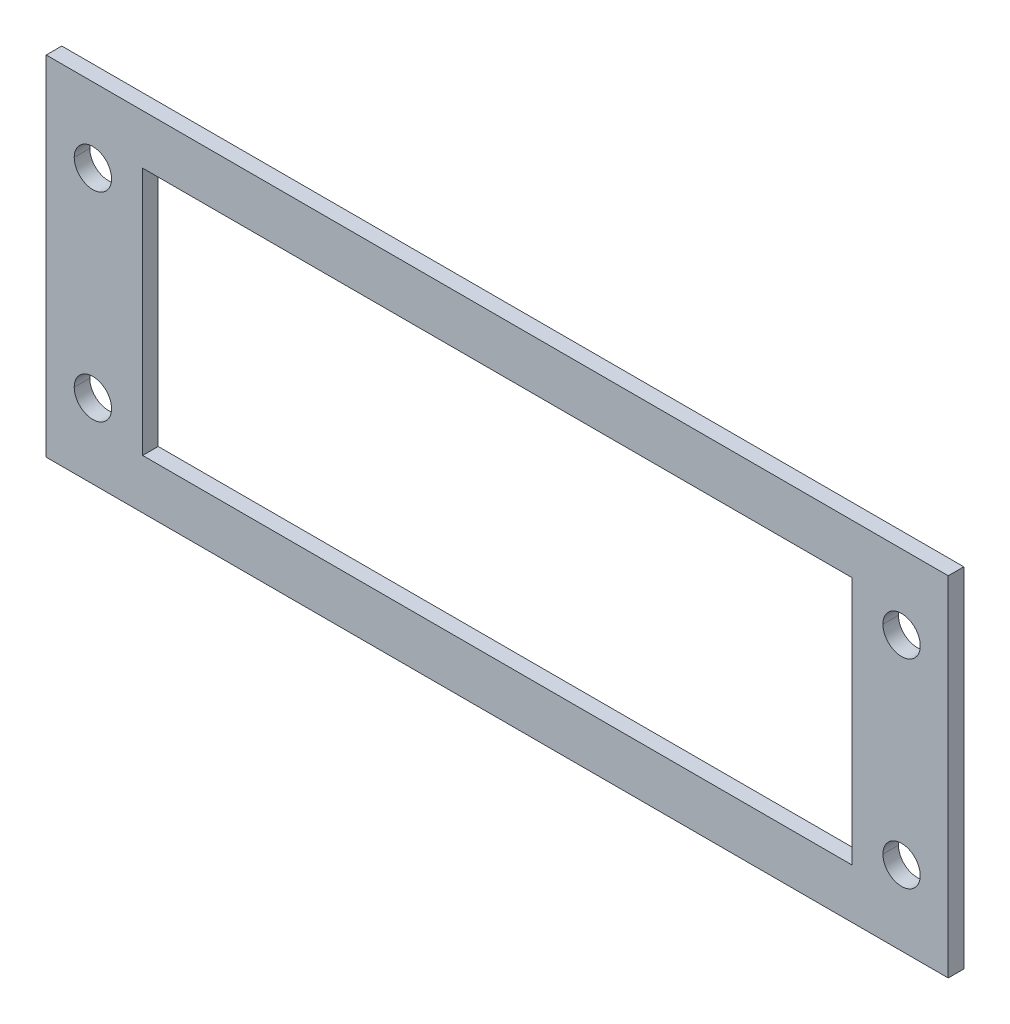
ISO-10303-21;
HEADER;
FILE_DESCRIPTION(('STEP AP214'),'2;1');
FILE_NAME('part.step','',(''),(''),'','','');
FILE_SCHEMA(('AUTOMOTIVE_DESIGN { 1 0 10303 214 1 1 1 1 }'));
ENDSEC;
DATA;
#1=APPLICATION_CONTEXT('core data for automotive mechanical design processes');
#2=APPLICATION_PROTOCOL_DEFINITION('international standard','automotive_design',2000,#1);
#3=PRODUCT_CONTEXT('',#1,'mechanical');
#4=PRODUCT('Part','Part','',(#3));
#5=PRODUCT_RELATED_PRODUCT_CATEGORY('part','',(#4));
#6=PRODUCT_DEFINITION_FORMATION('','',#4);
#7=PRODUCT_DEFINITION_CONTEXT('part definition',#1,'design');
#8=PRODUCT_DEFINITION('design','',#6,#7);
#9=PRODUCT_DEFINITION_SHAPE('','',#8);
#10=(LENGTH_UNIT() NAMED_UNIT(*) SI_UNIT(.MILLI.,.METRE.));
#11=(NAMED_UNIT(*) PLANE_ANGLE_UNIT() SI_UNIT($,.RADIAN.));
#12=(NAMED_UNIT(*) SI_UNIT($,.STERADIAN.) SOLID_ANGLE_UNIT());
#13=UNCERTAINTY_MEASURE_WITH_UNIT(LENGTH_MEASURE(1.E-05),#10,'distance_accuracy_value','');
#14=(GEOMETRIC_REPRESENTATION_CONTEXT(3) GLOBAL_UNCERTAINTY_ASSIGNED_CONTEXT((#13)) GLOBAL_UNIT_ASSIGNED_CONTEXT((#10,
#11,#12)) REPRESENTATION_CONTEXT('',''));
#15=CARTESIAN_POINT('',(0.,0.,0.));
#16=DIRECTION('',(0.,0.,1.));
#17=DIRECTION('',(1.,0.,0.));
#18=AXIS2_PLACEMENT_3D('',#15,#16,#17);
#19=CARTESIAN_POINT('',(65.,16.,28.0352813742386));
#20=DIRECTION('',(0.,0.,-1.));
#21=DIRECTION('',(-1.,0.,0.));
#22=AXIS2_PLACEMENT_3D('',#19,#20,#21);
#23=CYLINDRICAL_SURFACE('',#22,3.);
#24=DIRECTION('',(0.,0.,-1.));
#25=VECTOR('',#24,1.);
#26=CARTESIAN_POINT('',(68.,16.,28.0352813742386));
#27=LINE('',#26,#25);
#28=CARTESIAN_POINT('',(68.,16.,19.55));
#29=VERTEX_POINT('',#28);
#30=CARTESIAN_POINT('',(68.,16.,17.05));
#31=VERTEX_POINT('',#30);
#32=EDGE_CURVE('E201',#29,#31,#27,.T.);
#33=ORIENTED_EDGE('',*,*,#32,.F.);
#34=CARTESIAN_POINT('',(65.,16.,19.55));
#35=DIRECTION('',(0.,0.,-1.));
#36=DIRECTION('',(-1.,0.,0.));
#37=AXIS2_PLACEMENT_3D('',#34,#35,#36);
#38=CIRCLE('',#37,3.);
#39=CARTESIAN_POINT('',(62.,16.,19.55));
#40=VERTEX_POINT('',#39);
#41=EDGE_CURVE('E195',#40,#29,#38,.T.);
#42=ORIENTED_EDGE('',*,*,#41,.F.);
#43=DIRECTION('',(0.,0.,-1.));
#44=VECTOR('',#43,1.);
#45=CARTESIAN_POINT('',(62.,16.,28.0352813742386));
#46=LINE('',#45,#44);
#47=CARTESIAN_POINT('',(62.,16.,17.05));
#48=VERTEX_POINT('',#47);
#49=EDGE_CURVE('E220',#40,#48,#46,.T.);
#50=ORIENTED_EDGE('',*,*,#49,.T.);
#51=CARTESIAN_POINT('',(65.,16.,17.05));
#52=DIRECTION('',(0.,0.,1.));
#53=DIRECTION('',(1.,0.,0.));
#54=AXIS2_PLACEMENT_3D('',#51,#52,#53);
#55=CIRCLE('',#54,3.);
#56=EDGE_CURVE('E206',#31,#48,#55,.T.);
#57=ORIENTED_EDGE('',*,*,#56,.F.);
#58=EDGE_LOOP('',(#33,#42,#50,#57));
#59=FACE_BOUND('',#58,.T.);
#60=ADVANCED_FACE('F15',(#59),#23,.F.);
#61=CARTESIAN_POINT('',(-65.,16.,28.0352813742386));
#62=DIRECTION('',(0.,0.,-1.));
#63=DIRECTION('',(-1.,0.,0.));
#64=AXIS2_PLACEMENT_3D('',#61,#62,#63);
#65=CYLINDRICAL_SURFACE('',#64,3.);
#66=DIRECTION('',(0.,0.,-1.));
#67=VECTOR('',#66,1.);
#68=CARTESIAN_POINT('',(-62.,16.,28.0352813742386));
#69=LINE('',#68,#67);
#70=CARTESIAN_POINT('',(-62.,16.,19.55));
#71=VERTEX_POINT('',#70);
#72=CARTESIAN_POINT('',(-62.,16.,17.05));
#73=VERTEX_POINT('',#72);
#74=EDGE_CURVE('E232',#71,#73,#69,.T.);
#75=ORIENTED_EDGE('',*,*,#74,.F.);
#76=CARTESIAN_POINT('',(-65.,16.,19.55));
#77=DIRECTION('',(0.,0.,-1.));
#78=DIRECTION('',(-1.,0.,0.));
#79=AXIS2_PLACEMENT_3D('',#76,#77,#78);
#80=CIRCLE('',#79,3.);
#81=CARTESIAN_POINT('',(-68.,16.,19.55));
#82=VERTEX_POINT('',#81);
#83=EDGE_CURVE('E306',#82,#71,#80,.T.);
#84=ORIENTED_EDGE('',*,*,#83,.F.);
#85=DIRECTION('',(0.,0.,-1.));
#86=VECTOR('',#85,1.);
#87=CARTESIAN_POINT('',(-68.,16.,28.0352813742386));
#88=LINE('',#87,#86);
#89=CARTESIAN_POINT('',(-68.,16.,17.05));
#90=VERTEX_POINT('',#89);
#91=EDGE_CURVE('E246',#82,#90,#88,.T.);
#92=ORIENTED_EDGE('',*,*,#91,.T.);
#93=CARTESIAN_POINT('',(-65.,16.,17.05));
#94=DIRECTION('',(0.,0.,1.));
#95=DIRECTION('',(1.,0.,0.));
#96=AXIS2_PLACEMENT_3D('',#93,#94,#95);
#97=CIRCLE('',#96,3.);
#98=EDGE_CURVE('E313',#73,#90,#97,.T.);
#99=ORIENTED_EDGE('',*,*,#98,.F.);
#100=EDGE_LOOP('',(#75,#84,#92,#99));
#101=FACE_BOUND('',#100,.T.);
#102=ADVANCED_FACE('F367',(#101),#65,.F.);
#103=CARTESIAN_POINT('',(65.,-16.,140.363906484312));
#104=DIRECTION('',(0.,0.,-1.));
#105=DIRECTION('',(-1.,0.,0.));
#106=AXIS2_PLACEMENT_3D('',#103,#104,#105);
#107=CYLINDRICAL_SURFACE('',#106,3.);
#108=DIRECTION('',(0.,0.,-1.));
#109=VECTOR('',#108,1.);
#110=CARTESIAN_POINT('',(68.,-16.,140.363906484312));
#111=LINE('',#110,#109);
#112=CARTESIAN_POINT('',(68.,-16.,19.55));
#113=VERTEX_POINT('',#112);
#114=CARTESIAN_POINT('',(68.,-16.,17.05));
#115=VERTEX_POINT('',#114);
#116=EDGE_CURVE('E211',#113,#115,#111,.T.);
#117=ORIENTED_EDGE('',*,*,#116,.F.);
#118=CARTESIAN_POINT('',(65.,-16.,19.55));
#119=DIRECTION('',(0.,0.,-1.));
#120=DIRECTION('',(-1.,0.,0.));
#121=AXIS2_PLACEMENT_3D('',#118,#119,#120);
#122=CIRCLE('',#121,3.);
#123=CARTESIAN_POINT('',(62.,-16.,19.55));
#124=VERTEX_POINT('',#123);
#125=EDGE_CURVE('E303',#124,#113,#122,.T.);
#126=ORIENTED_EDGE('',*,*,#125,.F.);
#127=DIRECTION('',(0.,0.,-1.));
#128=VECTOR('',#127,1.);
#129=CARTESIAN_POINT('',(62.,-16.,140.363906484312));
#130=LINE('',#129,#128);
#131=CARTESIAN_POINT('',(62.,-16.,17.05));
#132=VERTEX_POINT('',#131);
#133=EDGE_CURVE('E224',#124,#132,#130,.T.);
#134=ORIENTED_EDGE('',*,*,#133,.T.);
#135=CARTESIAN_POINT('',(65.,-16.,17.05));
#136=DIRECTION('',(0.,0.,1.));
#137=DIRECTION('',(1.,0.,0.));
#138=AXIS2_PLACEMENT_3D('',#135,#136,#137);
#139=CIRCLE('',#138,3.);
#140=EDGE_CURVE('E210',#115,#132,#139,.T.);
#141=ORIENTED_EDGE('',*,*,#140,.F.);
#142=EDGE_LOOP('',(#117,#126,#134,#141));
#143=FACE_BOUND('',#142,.T.);
#144=ADVANCED_FACE('F372',(#143),#107,.F.);
#145=CARTESIAN_POINT('',(-65.,-16.,140.363906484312));
#146=DIRECTION('',(0.,0.,-1.));
#147=DIRECTION('',(-1.,0.,0.));
#148=AXIS2_PLACEMENT_3D('',#145,#146,#147);
#149=CYLINDRICAL_SURFACE('',#148,3.);
#150=DIRECTION('',(0.,0.,-1.));
#151=VECTOR('',#150,1.);
#152=CARTESIAN_POINT('',(-62.,-16.,140.363906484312));
#153=LINE('',#152,#151);
#154=CARTESIAN_POINT('',(-62.,-16.,19.55));
#155=VERTEX_POINT('',#154);
#156=CARTESIAN_POINT('',(-62.,-16.,17.05));
#157=VERTEX_POINT('',#156);
#158=EDGE_CURVE('E237',#155,#157,#153,.T.);
#159=ORIENTED_EDGE('',*,*,#158,.F.);
#160=CARTESIAN_POINT('',(-65.,-16.,19.55));
#161=DIRECTION('',(0.,0.,-1.));
#162=DIRECTION('',(-1.,0.,0.));
#163=AXIS2_PLACEMENT_3D('',#160,#161,#162);
#164=CIRCLE('',#163,3.);
#165=CARTESIAN_POINT('',(-68.,-16.,19.55));
#166=VERTEX_POINT('',#165);
#167=EDGE_CURVE('E300',#166,#155,#164,.T.);
#168=ORIENTED_EDGE('',*,*,#167,.F.);
#169=DIRECTION('',(0.,0.,-1.));
#170=VECTOR('',#169,1.);
#171=CARTESIAN_POINT('',(-68.,-16.,140.363906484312));
#172=LINE('',#171,#170);
#173=CARTESIAN_POINT('',(-68.,-16.,17.05));
#174=VERTEX_POINT('',#173);
#175=EDGE_CURVE('E250',#166,#174,#172,.T.);
#176=ORIENTED_EDGE('',*,*,#175,.T.);
#177=CARTESIAN_POINT('',(-65.,-16.,17.05));
#178=DIRECTION('',(0.,0.,1.));
#179=DIRECTION('',(1.,0.,0.));
#180=AXIS2_PLACEMENT_3D('',#177,#178,#179);
#181=CIRCLE('',#180,3.);
#182=EDGE_CURVE('E316',#157,#174,#181,.T.);
#183=ORIENTED_EDGE('',*,*,#182,.F.);
#184=EDGE_LOOP('',(#159,#168,#176,#183));
#185=FACE_BOUND('',#184,.T.);
#186=ADVANCED_FACE('F416',(#185),#149,.F.);
#187=CARTESIAN_POINT('',(-57.,-20.,140.363906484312));
#188=DIRECTION('',(1.,0.,0.));
#189=DIRECTION('',(0.,1.,0.));
#190=AXIS2_PLACEMENT_3D('',#187,#188,#189);
#191=PLANE('',#190);
#192=DIRECTION('',(0.,0.,-1.));
#193=VECTOR('',#192,1.);
#194=CARTESIAN_POINT('',(-57.,-20.,140.363906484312));
#195=LINE('',#194,#193);
#196=CARTESIAN_POINT('',(-57.,-20.,19.55));
#197=VERTEX_POINT('',#196);
#198=CARTESIAN_POINT('',(-57.,-20.,17.05));
#199=VERTEX_POINT('',#198);
#200=EDGE_CURVE('E10',#197,#199,#195,.T.);
#201=ORIENTED_EDGE('',*,*,#200,.T.);
#202=DIRECTION('',(0.,-1.,0.));
#203=VECTOR('',#202,1.);
#204=CARTESIAN_POINT('',(-57.,-20.,17.05));
#205=LINE('',#204,#203);
#206=CARTESIAN_POINT('',(-57.,20.,17.05));
#207=VERTEX_POINT('',#206);
#208=EDGE_CURVE('E327',#207,#199,#205,.T.);
#209=ORIENTED_EDGE('',*,*,#208,.F.);
#210=DIRECTION('',(0.,0.,-1.));
#211=VECTOR('',#210,1.);
#212=CARTESIAN_POINT('',(-57.,20.,140.363906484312));
#213=LINE('',#212,#211);
#214=CARTESIAN_POINT('',(-57.,20.,19.55));
#215=VERTEX_POINT('',#214);
#216=EDGE_CURVE('E42',#215,#207,#213,.T.);
#217=ORIENTED_EDGE('',*,*,#216,.F.);
#218=DIRECTION('',(0.,1.,0.));
#219=VECTOR('',#218,1.);
#220=CARTESIAN_POINT('',(-57.,-20.,19.55));
#221=LINE('',#220,#219);
#222=EDGE_CURVE('E296',#197,#215,#221,.T.);
#223=ORIENTED_EDGE('',*,*,#222,.F.);
#224=EDGE_LOOP('',(#201,#209,#217,#223));
#225=FACE_BOUND('',#224,.T.);
#226=ADVANCED_FACE('F413',(#225),#191,.T.);
#227=CARTESIAN_POINT('',(-57.,-20.,140.363906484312));
#228=DIRECTION('',(0.,1.,0.));
#229=DIRECTION('',(1.,0.,0.));
#230=AXIS2_PLACEMENT_3D('',#227,#228,#229);
#231=PLANE('',#230);
#232=DIRECTION('',(0.,0.,-1.));
#233=VECTOR('',#232,1.);
#234=CARTESIAN_POINT('',(57.,-20.,140.363906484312));
#235=LINE('',#234,#233);
#236=CARTESIAN_POINT('',(57.,-20.,19.55));
#237=VERTEX_POINT('',#236);
#238=CARTESIAN_POINT('',(57.,-20.,17.05));
#239=VERTEX_POINT('',#238);
#240=EDGE_CURVE('E23',#237,#239,#235,.T.);
#241=ORIENTED_EDGE('',*,*,#240,.T.);
#242=DIRECTION('',(1.,0.,0.));
#243=VECTOR('',#242,1.);
#244=CARTESIAN_POINT('',(-57.,-20.,17.05));
#245=LINE('',#244,#243);
#246=EDGE_CURVE('E331',#199,#239,#245,.T.);
#247=ORIENTED_EDGE('',*,*,#246,.F.);
#248=ORIENTED_EDGE('',*,*,#200,.F.);
#249=DIRECTION('',(-1.,0.,0.));
#250=VECTOR('',#249,1.);
#251=CARTESIAN_POINT('',(-57.,-20.,19.55));
#252=LINE('',#251,#250);
#253=EDGE_CURVE('E292',#237,#197,#252,.T.);
#254=ORIENTED_EDGE('',*,*,#253,.F.);
#255=EDGE_LOOP('',(#241,#247,#248,#254));
#256=FACE_BOUND('',#255,.T.);
#257=ADVANCED_FACE('F347',(#256),#231,.T.);
#258=CARTESIAN_POINT('',(57.,-20.,140.363906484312));
#259=DIRECTION('',(-1.,0.,0.));
#260=DIRECTION('',(0.,0.,1.));
#261=AXIS2_PLACEMENT_3D('',#258,#259,#260);
#262=PLANE('',#261);
#263=DIRECTION('',(0.,0.,-1.));
#264=VECTOR('',#263,1.);
#265=CARTESIAN_POINT('',(57.,20.,140.363906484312));
#266=LINE('',#265,#264);
#267=CARTESIAN_POINT('',(57.,20.,19.55));
#268=VERTEX_POINT('',#267);
#269=CARTESIAN_POINT('',(57.,20.,17.05));
#270=VERTEX_POINT('',#269);
#271=EDGE_CURVE('E341',#268,#270,#266,.T.);
#272=ORIENTED_EDGE('',*,*,#271,.T.);
#273=DIRECTION('',(0.,1.,0.));
#274=VECTOR('',#273,1.);
#275=CARTESIAN_POINT('',(57.,-20.,17.05));
#276=LINE('',#275,#274);
#277=EDGE_CURVE('E319',#239,#270,#276,.T.);
#278=ORIENTED_EDGE('',*,*,#277,.F.);
#279=ORIENTED_EDGE('',*,*,#240,.F.);
#280=DIRECTION('',(0.,-1.,0.));
#281=VECTOR('',#280,1.);
#282=CARTESIAN_POINT('',(57.,-20.,19.55));
#283=LINE('',#282,#281);
#284=EDGE_CURVE('E288',#268,#237,#283,.T.);
#285=ORIENTED_EDGE('',*,*,#284,.F.);
#286=EDGE_LOOP('',(#272,#278,#279,#285));
#287=FACE_BOUND('',#286,.T.);
#288=ADVANCED_FACE('F353',(#287),#262,.T.);
#289=CARTESIAN_POINT('',(-57.,20.,140.363906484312));
#290=DIRECTION('',(0.,-1.,0.));
#291=DIRECTION('',(0.,0.,-1.));
#292=AXIS2_PLACEMENT_3D('',#289,#290,#291);
#293=PLANE('',#292);
#294=ORIENTED_EDGE('',*,*,#216,.T.);
#295=DIRECTION('',(-1.,0.,0.));
#296=VECTOR('',#295,1.);
#297=CARTESIAN_POINT('',(-57.,20.,17.05));
#298=LINE('',#297,#296);
#299=EDGE_CURVE('E323',#270,#207,#298,.T.);
#300=ORIENTED_EDGE('',*,*,#299,.F.);
#301=ORIENTED_EDGE('',*,*,#271,.F.);
#302=DIRECTION('',(1.,0.,0.));
#303=VECTOR('',#302,1.);
#304=CARTESIAN_POINT('',(-57.,20.,19.55));
#305=LINE('',#304,#303);
#306=EDGE_CURVE('E284',#215,#268,#305,.T.);
#307=ORIENTED_EDGE('',*,*,#306,.F.);
#308=EDGE_LOOP('',(#294,#300,#301,#307));
#309=FACE_BOUND('',#308,.T.);
#310=ADVANCED_FACE('F354',(#309),#293,.T.);
#311=CARTESIAN_POINT('',(-72.5,28.,19.55));
#312=DIRECTION('',(0.,-1.,0.));
#313=DIRECTION('',(0.,0.,-1.));
#314=AXIS2_PLACEMENT_3D('',#311,#312,#313);
#315=PLANE('',#314);
#316=DIRECTION('',(-1.,0.,0.));
#317=VECTOR('',#316,1.);
#318=CARTESIAN_POINT('',(-72.5,28.,17.05));
#319=LINE('',#318,#317);
#320=CARTESIAN_POINT('',(72.5,28.,17.05));
#321=VERTEX_POINT('',#320);
#322=CARTESIAN_POINT('',(-72.5,28.,17.05));
#323=VERTEX_POINT('',#322);
#324=EDGE_CURVE('E168',#321,#323,#319,.T.);
#325=ORIENTED_EDGE('',*,*,#324,.T.);
#326=DIRECTION('',(0.,0.,-1.));
#327=VECTOR('',#326,1.);
#328=CARTESIAN_POINT('',(-72.5,28.,19.55));
#329=LINE('',#328,#327);
#330=CARTESIAN_POINT('',(-72.5,28.,19.55));
#331=VERTEX_POINT('',#330);
#332=EDGE_CURVE('E257',#331,#323,#329,.T.);
#333=ORIENTED_EDGE('',*,*,#332,.F.);
#334=DIRECTION('',(-1.,0.,0.));
#335=VECTOR('',#334,1.);
#336=CARTESIAN_POINT('',(-72.5,28.,19.55));
#337=LINE('',#336,#335);
#338=CARTESIAN_POINT('',(72.5,28.,19.55));
#339=VERTEX_POINT('',#338);
#340=EDGE_CURVE('E171',#339,#331,#337,.T.);
#341=ORIENTED_EDGE('',*,*,#340,.F.);
#342=DIRECTION('',(0.,0.,-1.));
#343=VECTOR('',#342,1.);
#344=CARTESIAN_POINT('',(72.5,28.,19.55));
#345=LINE('',#344,#343);
#346=EDGE_CURVE('E164',#339,#321,#345,.T.);
#347=ORIENTED_EDGE('',*,*,#346,.T.);
#348=EDGE_LOOP('',(#325,#333,#341,#347));
#349=FACE_BOUND('',#348,.T.);
#350=ADVANCED_FACE('F166',(#349),#315,.F.);
#351=CARTESIAN_POINT('',(72.5,-28.,19.55));
#352=DIRECTION('',(-1.,0.,0.));
#353=DIRECTION('',(0.,0.,1.));
#354=AXIS2_PLACEMENT_3D('',#351,#352,#353);
#355=PLANE('',#354);
#356=DIRECTION('',(0.,1.,0.));
#357=VECTOR('',#356,1.);
#358=CARTESIAN_POINT('',(72.5,-28.,17.05));
#359=LINE('',#358,#357);
#360=CARTESIAN_POINT('',(72.5,-28.,17.05));
#361=VERTEX_POINT('',#360);
#362=EDGE_CURVE('E179',#361,#321,#359,.T.);
#363=ORIENTED_EDGE('',*,*,#362,.T.);
#364=ORIENTED_EDGE('',*,*,#346,.F.);
#365=DIRECTION('',(0.,1.,0.));
#366=VECTOR('',#365,1.);
#367=CARTESIAN_POINT('',(72.5,-28.,19.55));
#368=LINE('',#367,#366);
#369=CARTESIAN_POINT('',(72.5,-28.,19.55));
#370=VERTEX_POINT('',#369);
#371=EDGE_CURVE('E279',#370,#339,#368,.T.);
#372=ORIENTED_EDGE('',*,*,#371,.F.);
#373=DIRECTION('',(0.,0.,-1.));
#374=VECTOR('',#373,1.);
#375=CARTESIAN_POINT('',(72.5,-28.,19.55));
#376=LINE('',#375,#374);
#377=EDGE_CURVE('E176',#370,#361,#376,.T.);
#378=ORIENTED_EDGE('',*,*,#377,.T.);
#379=EDGE_LOOP('',(#363,#364,#372,#378));
#380=FACE_BOUND('',#379,.T.);
#381=ADVANCED_FACE('F180',(#380),#355,.F.);
#382=CARTESIAN_POINT('',(-72.5,-28.,19.55));
#383=DIRECTION('',(0.,1.,0.));
#384=DIRECTION('',(1.,0.,0.));
#385=AXIS2_PLACEMENT_3D('',#382,#383,#384);
#386=PLANE('',#385);
#387=DIRECTION('',(1.,0.,0.));
#388=VECTOR('',#387,1.);
#389=CARTESIAN_POINT('',(-72.5,-28.,17.05));
#390=LINE('',#389,#388);
#391=CARTESIAN_POINT('',(-72.5,-28.,17.05));
#392=VERTEX_POINT('',#391);
#393=EDGE_CURVE('E185',#392,#361,#390,.T.);
#394=ORIENTED_EDGE('',*,*,#393,.T.);
#395=ORIENTED_EDGE('',*,*,#377,.F.);
#396=DIRECTION('',(1.,0.,0.));
#397=VECTOR('',#396,1.);
#398=CARTESIAN_POINT('',(-72.5,-28.,19.55));
#399=LINE('',#398,#397);
#400=CARTESIAN_POINT('',(-72.5,-28.,19.55));
#401=VERTEX_POINT('',#400);
#402=EDGE_CURVE('E275',#401,#370,#399,.T.);
#403=ORIENTED_EDGE('',*,*,#402,.F.);
#404=DIRECTION('',(0.,0.,-1.));
#405=VECTOR('',#404,1.);
#406=CARTESIAN_POINT('',(-72.5,-28.,19.55));
#407=LINE('',#406,#405);
#408=EDGE_CURVE('E209',#401,#392,#407,.T.);
#409=ORIENTED_EDGE('',*,*,#408,.T.);
#410=EDGE_LOOP('',(#394,#395,#403,#409));
#411=FACE_BOUND('',#410,.T.);
#412=ADVANCED_FACE('F398',(#411),#386,.F.);
#413=CARTESIAN_POINT('',(-72.5,-28.,19.55));
#414=DIRECTION('',(1.,0.,0.));
#415=DIRECTION('',(0.,1.,0.));
#416=AXIS2_PLACEMENT_3D('',#413,#414,#415);
#417=PLANE('',#416);
#418=DIRECTION('',(0.,-1.,0.));
#419=VECTOR('',#418,1.);
#420=CARTESIAN_POINT('',(-72.5,-28.,17.05));
#421=LINE('',#420,#419);
#422=EDGE_CURVE('E189',#323,#392,#421,.T.);
#423=ORIENTED_EDGE('',*,*,#422,.T.);
#424=ORIENTED_EDGE('',*,*,#408,.F.);
#425=DIRECTION('',(0.,-1.,0.));
#426=VECTOR('',#425,1.);
#427=CARTESIAN_POINT('',(-72.5,-28.,19.55));
#428=LINE('',#427,#426);
#429=EDGE_CURVE('E271',#331,#401,#428,.T.);
#430=ORIENTED_EDGE('',*,*,#429,.F.);
#431=ORIENTED_EDGE('',*,*,#332,.T.);
#432=EDGE_LOOP('',(#423,#424,#430,#431));
#433=FACE_BOUND('',#432,.T.);
#434=ADVANCED_FACE('F396',(#433),#417,.F.);
#435=CARTESIAN_POINT('',(-72.5,28.,17.05));
#436=DIRECTION('',(0.,0.,-1.));
#437=DIRECTION('',(0.,-1.,0.));
#438=AXIS2_PLACEMENT_3D('',#435,#436,#437);
#439=PLANE('',#438);
#440=CARTESIAN_POINT('',(65.,16.,17.05));
#441=DIRECTION('',(0.,0.,1.));
#442=DIRECTION('',(1.,0.,0.));
#443=AXIS2_PLACEMENT_3D('',#440,#441,#442);
#444=CIRCLE('',#443,3.);
#445=EDGE_CURVE('E205',#48,#31,#444,.T.);
#446=ORIENTED_EDGE('',*,*,#445,.T.);
#447=ORIENTED_EDGE('',*,*,#56,.T.);
#448=EDGE_LOOP('',(#446,#447));
#449=FACE_BOUND('',#448,.T.);
#450=CARTESIAN_POINT('',(65.,-16.,17.05));
#451=DIRECTION('',(0.,0.,1.));
#452=DIRECTION('',(1.,0.,0.));
#453=AXIS2_PLACEMENT_3D('',#450,#451,#452);
#454=CIRCLE('',#453,3.);
#455=EDGE_CURVE('E215',#132,#115,#454,.T.);
#456=ORIENTED_EDGE('',*,*,#455,.T.);
#457=ORIENTED_EDGE('',*,*,#140,.T.);
#458=EDGE_LOOP('',(#456,#457));
#459=FACE_BOUND('',#458,.T.);
#460=ORIENTED_EDGE('',*,*,#277,.T.);
#461=ORIENTED_EDGE('',*,*,#299,.T.);
#462=ORIENTED_EDGE('',*,*,#208,.T.);
#463=ORIENTED_EDGE('',*,*,#246,.T.);
#464=EDGE_LOOP('',(#460,#461,#462,#463));
#465=FACE_BOUND('',#464,.T.);
#466=CARTESIAN_POINT('',(-65.,-16.,17.05));
#467=DIRECTION('',(0.,0.,1.));
#468=DIRECTION('',(1.,0.,0.));
#469=AXIS2_PLACEMENT_3D('',#466,#467,#468);
#470=CIRCLE('',#469,3.);
#471=EDGE_CURVE('E241',#174,#157,#470,.T.);
#472=ORIENTED_EDGE('',*,*,#471,.T.);
#473=ORIENTED_EDGE('',*,*,#182,.T.);
#474=EDGE_LOOP('',(#472,#473));
#475=FACE_BOUND('',#474,.T.);
#476=CARTESIAN_POINT('',(-65.,16.,17.05));
#477=DIRECTION('',(0.,0.,1.));
#478=DIRECTION('',(1.,0.,0.));
#479=AXIS2_PLACEMENT_3D('',#476,#477,#478);
#480=CIRCLE('',#479,3.);
#481=EDGE_CURVE('E235',#90,#73,#480,.T.);
#482=ORIENTED_EDGE('',*,*,#481,.T.);
#483=ORIENTED_EDGE('',*,*,#98,.T.);
#484=EDGE_LOOP('',(#482,#483));
#485=FACE_BOUND('',#484,.T.);
#486=ORIENTED_EDGE('',*,*,#422,.F.);
#487=ORIENTED_EDGE('',*,*,#324,.F.);
#488=ORIENTED_EDGE('',*,*,#362,.F.);
#489=ORIENTED_EDGE('',*,*,#393,.F.);
#490=EDGE_LOOP('',(#486,#487,#488,#489));
#491=FACE_BOUND('',#490,.T.);
#492=ADVANCED_FACE('F187',(#449,#459,#465,#475,#485,#491),#439,.T.);
#493=CARTESIAN_POINT('',(-72.5,28.,19.55));
#494=DIRECTION('',(0.,0.,-1.));
#495=DIRECTION('',(0.,-1.,0.));
#496=AXIS2_PLACEMENT_3D('',#493,#494,#495);
#497=PLANE('',#496);
#498=ORIENTED_EDGE('',*,*,#41,.T.);
#499=CARTESIAN_POINT('',(65.,16.,19.55));
#500=DIRECTION('',(0.,0.,-1.));
#501=DIRECTION('',(-1.,0.,0.));
#502=AXIS2_PLACEMENT_3D('',#499,#500,#501);
#503=CIRCLE('',#502,3.);
#504=EDGE_CURVE('E198',#29,#40,#503,.T.);
#505=ORIENTED_EDGE('',*,*,#504,.T.);
#506=EDGE_LOOP('',(#498,#505));
#507=FACE_BOUND('',#506,.T.);
#508=ORIENTED_EDGE('',*,*,#83,.T.);
#509=CARTESIAN_POINT('',(-65.,16.,19.55));
#510=DIRECTION('',(0.,0.,-1.));
#511=DIRECTION('',(-1.,0.,0.));
#512=AXIS2_PLACEMENT_3D('',#509,#510,#511);
#513=CIRCLE('',#512,3.);
#514=EDGE_CURVE('E228',#71,#82,#513,.T.);
#515=ORIENTED_EDGE('',*,*,#514,.T.);
#516=EDGE_LOOP('',(#508,#515));
#517=FACE_BOUND('',#516,.T.);
#518=ORIENTED_EDGE('',*,*,#125,.T.);
#519=CARTESIAN_POINT('',(65.,-16.,19.55));
#520=DIRECTION('',(0.,0.,-1.));
#521=DIRECTION('',(-1.,0.,0.));
#522=AXIS2_PLACEMENT_3D('',#519,#520,#521);
#523=CIRCLE('',#522,3.);
#524=EDGE_CURVE('E216',#113,#124,#523,.T.);
#525=ORIENTED_EDGE('',*,*,#524,.T.);
#526=EDGE_LOOP('',(#518,#525));
#527=FACE_BOUND('',#526,.T.);
#528=ORIENTED_EDGE('',*,*,#167,.T.);
#529=CARTESIAN_POINT('',(-65.,-16.,19.55));
#530=DIRECTION('',(0.,0.,-1.));
#531=DIRECTION('',(-1.,0.,0.));
#532=AXIS2_PLACEMENT_3D('',#529,#530,#531);
#533=CIRCLE('',#532,3.);
#534=EDGE_CURVE('E242',#155,#166,#533,.T.);
#535=ORIENTED_EDGE('',*,*,#534,.T.);
#536=EDGE_LOOP('',(#528,#535));
#537=FACE_BOUND('',#536,.T.);
#538=ORIENTED_EDGE('',*,*,#306,.T.);
#539=ORIENTED_EDGE('',*,*,#284,.T.);
#540=ORIENTED_EDGE('',*,*,#253,.T.);
#541=ORIENTED_EDGE('',*,*,#222,.T.);
#542=EDGE_LOOP('',(#538,#539,#540,#541));
#543=FACE_BOUND('',#542,.T.);
#544=ORIENTED_EDGE('',*,*,#429,.T.);
#545=ORIENTED_EDGE('',*,*,#402,.T.);
#546=ORIENTED_EDGE('',*,*,#371,.T.);
#547=ORIENTED_EDGE('',*,*,#340,.T.);
#548=EDGE_LOOP('',(#544,#545,#546,#547));
#549=FACE_BOUND('',#548,.T.);
#550=ADVANCED_FACE('F381',(#507,#517,#527,#537,#543,#549),#497,.F.);
#551=CARTESIAN_POINT('',(-65.,-16.,140.363906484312));
#552=DIRECTION('',(0.,0.,-1.));
#553=DIRECTION('',(-1.,0.,0.));
#554=AXIS2_PLACEMENT_3D('',#551,#552,#553);
#555=CYLINDRICAL_SURFACE('',#554,3.);
#556=ORIENTED_EDGE('',*,*,#534,.F.);
#557=ORIENTED_EDGE('',*,*,#158,.T.);
#558=ORIENTED_EDGE('',*,*,#471,.F.);
#559=ORIENTED_EDGE('',*,*,#175,.F.);
#560=EDGE_LOOP('',(#556,#557,#558,#559));
#561=FACE_BOUND('',#560,.T.);
#562=ADVANCED_FACE('F384',(#561),#555,.F.);
#563=CARTESIAN_POINT('',(65.,-16.,140.363906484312));
#564=DIRECTION('',(0.,0.,-1.));
#565=DIRECTION('',(-1.,0.,0.));
#566=AXIS2_PLACEMENT_3D('',#563,#564,#565);
#567=CYLINDRICAL_SURFACE('',#566,3.);
#568=ORIENTED_EDGE('',*,*,#524,.F.);
#569=ORIENTED_EDGE('',*,*,#116,.T.);
#570=ORIENTED_EDGE('',*,*,#455,.F.);
#571=ORIENTED_EDGE('',*,*,#133,.F.);
#572=EDGE_LOOP('',(#568,#569,#570,#571));
#573=FACE_BOUND('',#572,.T.);
#574=ADVANCED_FACE('F428',(#573),#567,.F.);
#575=CARTESIAN_POINT('',(-65.,16.,28.0352813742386));
#576=DIRECTION('',(0.,0.,-1.));
#577=DIRECTION('',(-1.,0.,0.));
#578=AXIS2_PLACEMENT_3D('',#575,#576,#577);
#579=CYLINDRICAL_SURFACE('',#578,3.);
#580=ORIENTED_EDGE('',*,*,#514,.F.);
#581=ORIENTED_EDGE('',*,*,#74,.T.);
#582=ORIENTED_EDGE('',*,*,#481,.F.);
#583=ORIENTED_EDGE('',*,*,#91,.F.);
#584=EDGE_LOOP('',(#580,#581,#582,#583));
#585=FACE_BOUND('',#584,.T.);
#586=ADVANCED_FACE('F431',(#585),#579,.F.);
#587=CARTESIAN_POINT('',(65.,16.,28.0352813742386));
#588=DIRECTION('',(0.,0.,-1.));
#589=DIRECTION('',(-1.,0.,0.));
#590=AXIS2_PLACEMENT_3D('',#587,#588,#589);
#591=CYLINDRICAL_SURFACE('',#590,3.);
#592=ORIENTED_EDGE('',*,*,#504,.F.);
#593=ORIENTED_EDGE('',*,*,#32,.T.);
#594=ORIENTED_EDGE('',*,*,#445,.F.);
#595=ORIENTED_EDGE('',*,*,#49,.F.);
#596=EDGE_LOOP('',(#592,#593,#594,#595));
#597=FACE_BOUND('',#596,.T.);
#598=ADVANCED_FACE('F379',(#597),#591,.F.);
#599=CLOSED_SHELL('',(#60,#102,#144,#186,#226,#257,#288,#310,#350,#381,#412,#434,#492,#550,#562,
#574,#586,#598));
#600=MANIFOLD_SOLID_BREP('B1',#599);
#601=ADVANCED_BREP_SHAPE_REPRESENTATION('',(#18,#600),#14);
#602=SHAPE_DEFINITION_REPRESENTATION(#9,#601);
ENDSEC;
END-ISO-10303-21;
